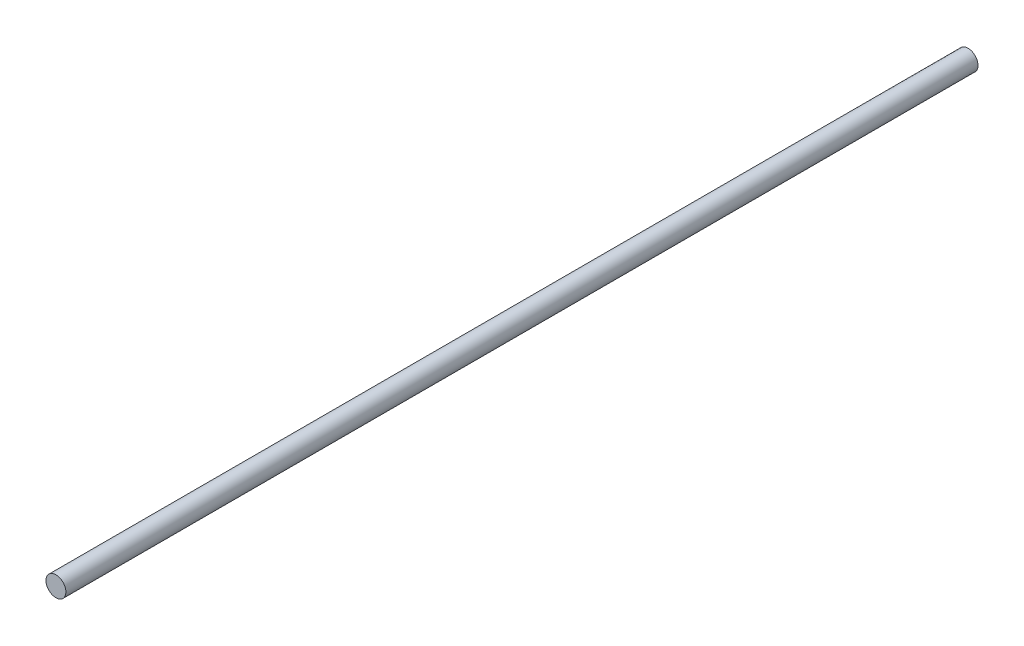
ISO-10303-21;
HEADER;
FILE_DESCRIPTION(('STEP AP214'),'2;1');
FILE_NAME('part.step','',(''),(''),'','','');
FILE_SCHEMA(('AUTOMOTIVE_DESIGN { 1 0 10303 214 1 1 1 1 }'));
ENDSEC;
DATA;
#1=APPLICATION_CONTEXT('core data for automotive mechanical design processes');
#2=APPLICATION_PROTOCOL_DEFINITION('international standard','automotive_design',2000,#1);
#3=PRODUCT_CONTEXT('',#1,'mechanical');
#4=PRODUCT('Part','Part','',(#3));
#5=PRODUCT_RELATED_PRODUCT_CATEGORY('part','',(#4));
#6=PRODUCT_DEFINITION_FORMATION('','',#4);
#7=PRODUCT_DEFINITION_CONTEXT('part definition',#1,'design');
#8=PRODUCT_DEFINITION('design','',#6,#7);
#9=PRODUCT_DEFINITION_SHAPE('','',#8);
#10=(LENGTH_UNIT() NAMED_UNIT(*) SI_UNIT(.MILLI.,.METRE.));
#11=(NAMED_UNIT(*) PLANE_ANGLE_UNIT() SI_UNIT($,.RADIAN.));
#12=(NAMED_UNIT(*) SI_UNIT($,.STERADIAN.) SOLID_ANGLE_UNIT());
#13=UNCERTAINTY_MEASURE_WITH_UNIT(LENGTH_MEASURE(1.E-05),#10,'distance_accuracy_value','');
#14=(GEOMETRIC_REPRESENTATION_CONTEXT(3) GLOBAL_UNCERTAINTY_ASSIGNED_CONTEXT((#13)) GLOBAL_UNIT_ASSIGNED_CONTEXT((#10,
#11,#12)) REPRESENTATION_CONTEXT('',''));
#15=CARTESIAN_POINT('',(0.,0.,0.));
#16=DIRECTION('',(0.,0.,1.));
#17=DIRECTION('',(1.,0.,0.));
#18=AXIS2_PLACEMENT_3D('',#15,#16,#17);
#19=CARTESIAN_POINT('',(0.,0.,-2750.));
#20=DIRECTION('',(0.,0.,1.));
#21=DIRECTION('',(1.,0.,0.));
#22=AXIS2_PLACEMENT_3D('',#19,#20,#21);
#23=CYLINDRICAL_SURFACE('',#22,30.);
#24=CARTESIAN_POINT('',(0.,0.,-2750.));
#25=DIRECTION('',(0.,0.,1.));
#26=DIRECTION('',(1.,0.,0.));
#27=AXIS2_PLACEMENT_3D('',#24,#25,#26);
#28=CIRCLE('',#27,30.);
#29=CARTESIAN_POINT('',(30.,0.,-2750.));
#30=VERTEX_POINT('',#29);
#31=EDGE_CURVE('E10',#30,#30,#28,.T.);
#32=ORIENTED_EDGE('',*,*,#31,.T.);
#33=EDGE_LOOP('',(#32));
#34=FACE_BOUND('',#33,.T.);
#35=CARTESIAN_POINT('',(0.,0.,0.));
#36=DIRECTION('',(0.,0.,1.));
#37=DIRECTION('',(1.,0.,0.));
#38=AXIS2_PLACEMENT_3D('',#35,#36,#37);
#39=CIRCLE('',#38,30.);
#40=CARTESIAN_POINT('',(30.,0.,0.));
#41=VERTEX_POINT('',#40);
#42=EDGE_CURVE('E40',#41,#41,#39,.T.);
#43=ORIENTED_EDGE('',*,*,#42,.F.);
#44=EDGE_LOOP('',(#43));
#45=FACE_BOUND('',#44,.T.);
#46=ADVANCED_FACE('F37',(#34,#45),#23,.T.);
#47=CARTESIAN_POINT('',(0.,0.,-2750.));
#48=DIRECTION('',(0.,0.,1.));
#49=DIRECTION('',(1.,0.,0.));
#50=AXIS2_PLACEMENT_3D('',#47,#48,#49);
#51=PLANE('',#50);
#52=ORIENTED_EDGE('',*,*,#31,.F.);
#53=EDGE_LOOP('',(#52));
#54=FACE_BOUND('',#53,.T.);
#55=ADVANCED_FACE('F54',(#54),#51,.F.);
#56=CARTESIAN_POINT('',(0.,0.,0.));
#57=DIRECTION('',(0.,0.,1.));
#58=DIRECTION('',(1.,0.,0.));
#59=AXIS2_PLACEMENT_3D('',#56,#57,#58);
#60=PLANE('',#59);
#61=ORIENTED_EDGE('',*,*,#42,.T.);
#62=EDGE_LOOP('',(#61));
#63=FACE_BOUND('',#62,.T.);
#64=ADVANCED_FACE('F51',(#63),#60,.T.);
#65=CLOSED_SHELL('',(#46,#55,#64));
#66=MANIFOLD_SOLID_BREP('B2',#65);
#67=ADVANCED_BREP_SHAPE_REPRESENTATION('',(#18,#66),#14);
#68=SHAPE_DEFINITION_REPRESENTATION(#9,#67);
ENDSEC;
END-ISO-10303-21;
